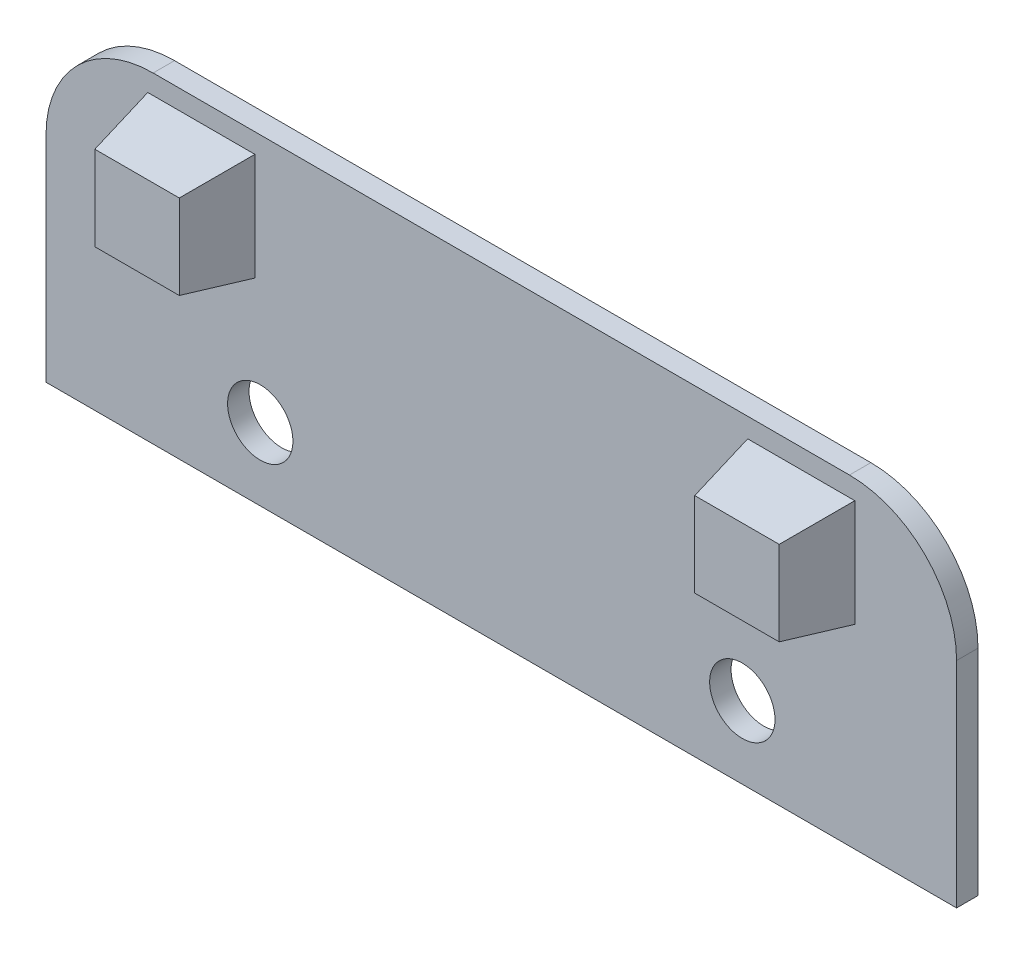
from build123d import *

# Parameters (mm, degrees)
ESQUISSE1_R      = 6.1
EXTRUSION1_DEPTH = 4
ESQUISSE2_W      = 20
ESQUISSE2_H      = 20
EXTRUSION2_DEPTH = 12
EXTRUSION2_TAPER = 10


with BuildPart() as part:
    # Esquisse1 → Extrusion1 (new body)
    with BuildSketch(Plane.XY):
        with BuildLine():
            Line((-85, 0), (85, 0))
            Line((85, 0), (85, 40))
            ThreePointArc((85, 40), (79.142135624, 54.142135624), (65, 60))
            Line((65, 60), (-65, 60))
            ThreePointArc((-65, 60), (-79.142135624, 54.142135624), (-85, 40))
            Line((-85, 40), (-85, 0))
        make_face()
        with Locations((-45, 13.5)):
            Circle(ESQUISSE1_R, mode=Mode.SUBTRACT)
        with Locations((45, 13.5)):
            Circle(ESQUISSE1_R, mode=Mode.SUBTRACT)
    extrude(amount=EXTRUSION1_DEPTH)

    # Esquisse2 → Extrusion2 (add)
    with BuildSketch(Plane.XY.offset(4)):
        with Locations((-56, 46.35)):
            Rectangle(ESQUISSE2_W, ESQUISSE2_H)
    extrusion2 = extrude(amount=EXTRUSION2_DEPTH, taper=EXTRUSION2_TAPER)

    # Sym_trie1: Extrusion2 across plane
    add(extrusion2.mirror(Plane(origin=(0, 0, 0), x_dir=(0, 0, 1), z_dir=(1, 0, 0))))


solid = part.part
